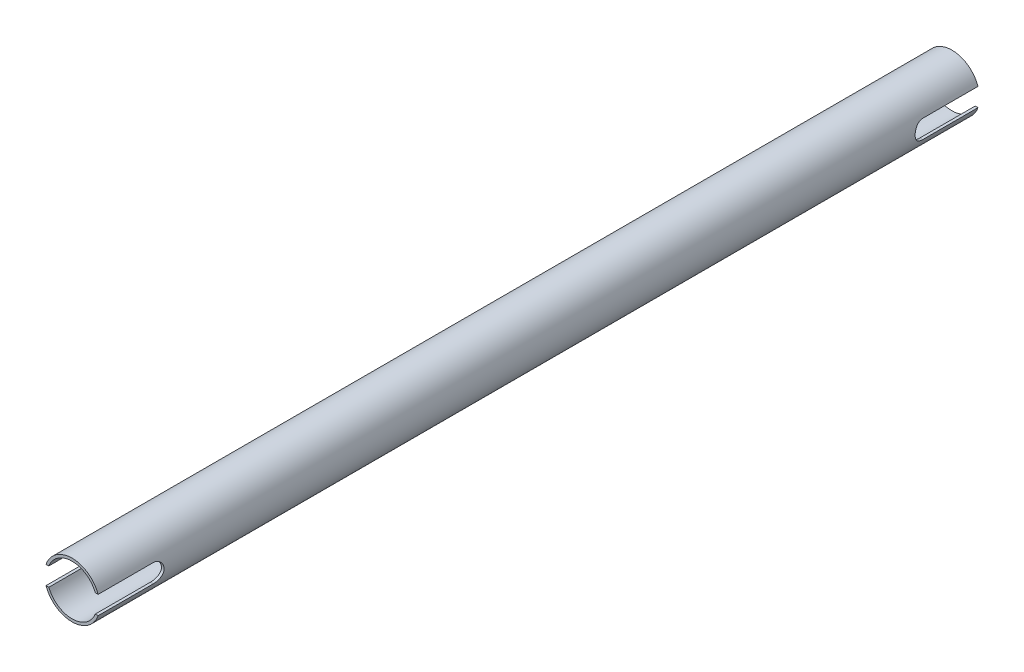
ISO-10303-21;
HEADER;
FILE_DESCRIPTION(('STEP AP214'),'2;1');
FILE_NAME('part.step','',(''),(''),'','','');
FILE_SCHEMA(('AUTOMOTIVE_DESIGN { 1 0 10303 214 1 1 1 1 }'));
ENDSEC;
DATA;
#1=APPLICATION_CONTEXT('core data for automotive mechanical design processes');
#2=APPLICATION_PROTOCOL_DEFINITION('international standard','automotive_design',2000,#1);
#3=PRODUCT_CONTEXT('',#1,'mechanical');
#4=PRODUCT('Part','Part','',(#3));
#5=PRODUCT_RELATED_PRODUCT_CATEGORY('part','',(#4));
#6=PRODUCT_DEFINITION_FORMATION('','',#4);
#7=PRODUCT_DEFINITION_CONTEXT('part definition',#1,'design');
#8=PRODUCT_DEFINITION('design','',#6,#7);
#9=PRODUCT_DEFINITION_SHAPE('','',#8);
#10=(LENGTH_UNIT() NAMED_UNIT(*) SI_UNIT(.MILLI.,.METRE.));
#11=(NAMED_UNIT(*) PLANE_ANGLE_UNIT() SI_UNIT($,.RADIAN.));
#12=(NAMED_UNIT(*) SI_UNIT($,.STERADIAN.) SOLID_ANGLE_UNIT());
#13=UNCERTAINTY_MEASURE_WITH_UNIT(LENGTH_MEASURE(1.E-05),#10,'distance_accuracy_value','');
#14=(GEOMETRIC_REPRESENTATION_CONTEXT(3) GLOBAL_UNCERTAINTY_ASSIGNED_CONTEXT((#13)) GLOBAL_UNIT_ASSIGNED_CONTEXT((#10,
#11,#12)) REPRESENTATION_CONTEXT('',''));
#15=CARTESIAN_POINT('',(0.,0.,0.));
#16=DIRECTION('',(0.,0.,1.));
#17=DIRECTION('',(1.,0.,0.));
#18=AXIS2_PLACEMENT_3D('',#15,#16,#17);
#19=CARTESIAN_POINT('',(0.,0.,151.69444769));
#20=DIRECTION('',(0.,0.,1.));
#21=DIRECTION('',(1.,0.,0.));
#22=AXIS2_PLACEMENT_3D('',#19,#20,#21);
#23=PLANE('',#22);
#24=CARTESIAN_POINT('',(0.,0.,151.69444769));
#25=DIRECTION('',(0.,0.,1.));
#26=DIRECTION('',(1.,0.,0.));
#27=AXIS2_PLACEMENT_3D('',#24,#25,#26);
#28=CIRCLE('',#27,9.525);
#29=CARTESIAN_POINT('',(8.98025612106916,3.17499999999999,151.69444769));
#30=VERTEX_POINT('',#29);
#31=CARTESIAN_POINT('',(-8.98025612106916,3.17499999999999,151.69444769));
#32=VERTEX_POINT('',#31);
#33=EDGE_CURVE('E180',#30,#32,#28,.T.);
#34=ORIENTED_EDGE('',*,*,#33,.T.);
#35=DIRECTION('',(1.,0.,0.));
#36=VECTOR('',#35,1.);
#37=CARTESIAN_POINT('',(-9.525,3.17499999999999,151.69444769));
#38=LINE('',#37,#36);
#39=CARTESIAN_POINT('',(-8.00659451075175,3.17499999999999,151.69444769));
#40=VERTEX_POINT('',#39);
#41=EDGE_CURVE('E447',#32,#40,#38,.T.);
#42=ORIENTED_EDGE('',*,*,#41,.T.);
#43=CARTESIAN_POINT('',(0.,0.,151.69444769));
#44=DIRECTION('',(0.,0.,1.));
#45=DIRECTION('',(1.,0.,0.));
#46=AXIS2_PLACEMENT_3D('',#43,#44,#45);
#47=CIRCLE('',#46,8.61314);
#48=CARTESIAN_POINT('',(8.00659451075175,3.17499999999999,151.69444769));
#49=VERTEX_POINT('',#48);
#50=EDGE_CURVE('E251',#49,#40,#47,.T.);
#51=ORIENTED_EDGE('',*,*,#50,.F.);
#52=EDGE_CURVE('E444',#49,#30,#38,.T.);
#53=ORIENTED_EDGE('',*,*,#52,.T.);
#54=EDGE_LOOP('',(#34,#42,#51,#53));
#55=FACE_BOUND('',#54,.T.);
#56=ADVANCED_FACE('F44',(#55),#23,.T.);
#57=CARTESIAN_POINT('',(-8.98025612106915,-3.17500000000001,151.69444769));
#58=VERTEX_POINT('',#57);
#59=CARTESIAN_POINT('',(8.98025612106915,-3.17500000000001,151.69444769));
#60=VERTEX_POINT('',#59);
#61=EDGE_CURVE('E172',#58,#60,#28,.T.);
#62=ORIENTED_EDGE('',*,*,#61,.T.);
#63=DIRECTION('',(1.,0.,0.));
#64=VECTOR('',#63,1.);
#65=CARTESIAN_POINT('',(-9.525,-3.17500000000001,151.69444769));
#66=LINE('',#65,#64);
#67=CARTESIAN_POINT('',(8.00659451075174,-3.17500000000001,151.69444769));
#68=VERTEX_POINT('',#67);
#69=EDGE_CURVE('E175',#68,#60,#66,.T.);
#70=ORIENTED_EDGE('',*,*,#69,.F.);
#71=CARTESIAN_POINT('',(-8.00659451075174,-3.17500000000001,151.69444769));
#72=VERTEX_POINT('',#71);
#73=EDGE_CURVE('E174',#72,#68,#47,.T.);
#74=ORIENTED_EDGE('',*,*,#73,.F.);
#75=EDGE_CURVE('E68',#58,#72,#66,.T.);
#76=ORIENTED_EDGE('',*,*,#75,.F.);
#77=EDGE_LOOP('',(#62,#70,#74,#76));
#78=FACE_BOUND('',#77,.T.);
#79=ADVANCED_FACE('F170',(#78),#23,.T.);
#80=CARTESIAN_POINT('',(0.,0.,151.69444769));
#81=DIRECTION('',(0.,0.,-1.));
#82=DIRECTION('',(-1.,0.,0.));
#83=AXIS2_PLACEMENT_3D('',#80,#81,#82);
#84=CYLINDRICAL_SURFACE('',#83,9.525);
#85=CARTESIAN_POINT('',(0.,0.,-151.69444769));
#86=DIRECTION('',(0.,0.,1.));
#87=DIRECTION('',(1.,0.,0.));
#88=AXIS2_PLACEMENT_3D('',#85,#86,#87);
#89=CIRCLE('',#88,9.525);
#90=CARTESIAN_POINT('',(-8.98025612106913,-3.17500000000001,-151.69444769));
#91=VERTEX_POINT('',#90);
#92=CARTESIAN_POINT('',(8.98025612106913,-3.17500000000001,-151.69444769));
#93=VERTEX_POINT('',#92);
#94=EDGE_CURVE('E186',#91,#93,#89,.T.);
#95=ORIENTED_EDGE('',*,*,#94,.T.);
#96=DIRECTION('',(0.,0.,-1.));
#97=VECTOR('',#96,1.);
#98=CARTESIAN_POINT('',(8.98025612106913,-3.17500000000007,151.69444769));
#99=LINE('',#98,#97);
#100=CARTESIAN_POINT('',(8.98025612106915,-3.17500000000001,-132.64444769));
#101=VERTEX_POINT('',#100);
#102=EDGE_CURVE('E236',#93,#101,#99,.F.);
#103=ORIENTED_EDGE('',*,*,#102,.T.);
#104=CARTESIAN_POINT('',(8.98025612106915,-3.17500000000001,-132.64444769));
#105=CARTESIAN_POINT('',(8.98024230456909,-3.17501141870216,-132.557824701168));
#106=CARTESIAN_POINT('',(8.98150913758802,-3.17145526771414,-132.471209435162));
#107=CARTESIAN_POINT('',(8.98650125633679,-3.15729678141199,-132.298650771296));
#108=CARTESIAN_POINT('',(8.99022587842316,-3.14669634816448,-132.212707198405));
#109=CARTESIAN_POINT('',(9.00001635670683,-3.11857973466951,-132.04235276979));
#110=CARTESIAN_POINT('',(9.0060752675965,-3.10108406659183,-131.95793813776));
#111=CARTESIAN_POINT('',(9.02033527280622,-3.05935609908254,-131.7909971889));
#112=CARTESIAN_POINT('',(9.0285364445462,-3.03512355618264,-131.708470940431));
#113=CARTESIAN_POINT('',(9.05598824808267,-2.95264270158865,-131.464666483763));
#114=CARTESIAN_POINT('',(9.07810279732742,-2.88456899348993,-131.306910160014));
#115=CARTESIAN_POINT('',(9.12745233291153,-2.7243758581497,-131.00503413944));
#116=CARTESIAN_POINT('',(9.15469046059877,-2.63224166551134,-130.860922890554));
#117=CARTESIAN_POINT('',(9.21240451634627,-2.42269004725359,-130.584770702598));
#118=CARTESIAN_POINT('',(9.24296080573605,-2.30449481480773,-130.453335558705));
#119=CARTESIAN_POINT('',(9.30318975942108,-2.04783780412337,-130.211740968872));
#120=CARTESIAN_POINT('',(9.33286226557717,-1.90937242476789,-130.101585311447));
#121=CARTESIAN_POINT('',(9.38891576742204,-1.61164171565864,-129.902900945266));
#122=CARTESIAN_POINT('',(9.4151906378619,-1.45192782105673,-129.815011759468));
#123=CARTESIAN_POINT('',(9.46053507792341,-1.1189628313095,-129.667592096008));
#124=CARTESIAN_POINT('',(9.47960684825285,-0.945715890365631,-129.608052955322));
#125=CARTESIAN_POINT('',(9.50782550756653,-0.596993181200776,-129.521086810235));
#126=CARTESIAN_POINT('',(9.5172945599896,-0.421804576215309,-129.49261481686));
#127=CARTESIAN_POINT('',(9.52638456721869,-0.0688942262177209,-129.465268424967));
#128=CARTESIAN_POINT('',(9.52600786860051,0.108826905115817,-129.466386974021));
#129=CARTESIAN_POINT('',(9.515666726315,0.454354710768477,-129.497528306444));
#130=CARTESIAN_POINT('',(9.50607893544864,0.622276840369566,-129.526415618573));
#131=CARTESIAN_POINT('',(9.47886599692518,0.950734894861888,-129.610396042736));
#132=CARTESIAN_POINT('',(9.4612404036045,1.11127040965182,-129.665490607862));
#133=CARTESIAN_POINT('',(9.41945246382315,1.422884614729,-129.800985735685));
#134=CARTESIAN_POINT('',(9.39520718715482,1.57381114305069,-129.881709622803));
#135=CARTESIAN_POINT('',(9.34270382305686,1.86031043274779,-130.065902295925));
#136=CARTESIAN_POINT('',(9.31444464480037,1.99587900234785,-130.169377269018));
#137=CARTESIAN_POINT('',(9.25532407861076,2.25455959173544,-130.401856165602));
#138=CARTESIAN_POINT('',(9.22440281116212,2.37678676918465,-130.531831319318));
#139=CARTESIAN_POINT('',(9.16455803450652,2.5980116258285,-130.810688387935));
#140=CARTESIAN_POINT('',(9.13563517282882,2.69700180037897,-130.959576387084));
#141=CARTESIAN_POINT('',(9.08272269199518,2.87021834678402,-131.275049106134));
#142=CARTESIAN_POINT('',(9.05881220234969,2.944057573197,-131.441862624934));
#143=CARTESIAN_POINT('',(9.02936653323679,3.03267330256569,-131.700080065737));
#144=CARTESIAN_POINT('',(9.02062228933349,3.05851877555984,-131.787469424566));
#145=CARTESIAN_POINT('',(9.00554368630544,3.1026369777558,-131.964331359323));
#146=CARTESIAN_POINT('',(8.99920822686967,3.12091316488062,-132.053802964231));
#147=CARTESIAN_POINT('',(8.98959087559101,3.14850521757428,-132.226652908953));
#148=CARTESIAN_POINT('',(8.9860995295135,3.15843785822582,-132.309922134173));
#149=CARTESIAN_POINT('',(8.98142776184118,3.17168561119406,-132.476940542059));
#150=CARTESIAN_POINT('',(8.98024435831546,3.17500926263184,-132.560688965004));
#151=CARTESIAN_POINT('',(8.98025612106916,3.17499999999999,-132.64444769));
#152=B_SPLINE_CURVE_WITH_KNOTS('',3,(#104,#105,#106,#107,#108,#109,#110,#111,#112,#113,#114,
#115,#116,#117,#118,#119,#120,#121,#122,#123,#124,#125,#126,#127,#128,#129,#130,#131,#132,#133,
#134,#135,#136,#137,#138,#139,#140,#141,#142,#143,#144,#145,#146,#147,#148,#149,#150,#151),
.UNSPECIFIED.,.F.,.F.,(4,2,2,2,2,2,2,2,2,2,2,2,2,2,2,2,2,2,2,2,2,2,2,4),(0.,0.259773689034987,
0.519477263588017,0.778414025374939,1.03736014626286,1.55449291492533,2.07194378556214,
2.60766387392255,3.14347925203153,3.69327981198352,4.24291225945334,4.77342553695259,
5.30381237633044,5.81339512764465,6.32300613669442,6.83932018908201,7.35577482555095,
7.89650105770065,8.43740168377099,8.98628729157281,9.26063415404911,9.5348555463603,
9.78636405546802,10.0375473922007),.UNSPECIFIED.);
#153=CARTESIAN_POINT('',(8.98025612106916,3.17499999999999,-132.64444769));
#154=VERTEX_POINT('',#153);
#155=EDGE_CURVE('E228',#101,#154,#152,.T.);
#156=ORIENTED_EDGE('',*,*,#155,.T.);
#157=DIRECTION('',(0.,0.,-1.));
#158=VECTOR('',#157,1.);
#159=CARTESIAN_POINT('',(8.98025612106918,3.17499999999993,151.69444769));
#160=LINE('',#159,#158);
#161=CARTESIAN_POINT('',(8.98025612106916,3.17499999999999,-151.69444769));
#162=VERTEX_POINT('',#161);
#163=EDGE_CURVE('E245',#154,#162,#160,.T.);
#164=ORIENTED_EDGE('',*,*,#163,.T.);
#165=CARTESIAN_POINT('',(-8.98025612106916,3.17499999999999,-151.69444769));
#166=VERTEX_POINT('',#165);
#167=EDGE_CURVE('E181',#162,#166,#89,.T.);
#168=ORIENTED_EDGE('',*,*,#167,.T.);
#169=DIRECTION('',(0.,0.,-1.));
#170=VECTOR('',#169,1.);
#171=CARTESIAN_POINT('',(-8.98025612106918,3.17499999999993,151.69444769));
#172=LINE('',#171,#170);
#173=CARTESIAN_POINT('',(-8.98025612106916,3.17499999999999,-132.64444769));
#174=VERTEX_POINT('',#173);
#175=EDGE_CURVE('E242',#166,#174,#172,.F.);
#176=ORIENTED_EDGE('',*,*,#175,.T.);
#177=CARTESIAN_POINT('',(-8.98025612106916,3.17499999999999,-132.64444769));
#178=CARTESIAN_POINT('',(-8.9802423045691,3.17501141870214,-132.557824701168));
#179=CARTESIAN_POINT('',(-8.98150913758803,3.17145526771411,-132.471209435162));
#180=CARTESIAN_POINT('',(-8.9865012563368,3.15729678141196,-132.298650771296));
#181=CARTESIAN_POINT('',(-8.99022587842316,3.14669634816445,-132.212707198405));
#182=CARTESIAN_POINT('',(-9.00001635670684,3.11857973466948,-132.04235276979));
#183=CARTESIAN_POINT('',(-9.00607526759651,3.1010840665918,-131.95793813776));
#184=CARTESIAN_POINT('',(-9.02033527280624,3.05935609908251,-131.7909971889));
#185=CARTESIAN_POINT('',(-9.02853644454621,3.03512355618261,-131.708470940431));
#186=CARTESIAN_POINT('',(-9.05598824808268,2.95264270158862,-131.464666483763));
#187=CARTESIAN_POINT('',(-9.07810279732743,2.8845689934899,-131.306910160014));
#188=CARTESIAN_POINT('',(-9.12745233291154,2.72437585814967,-131.00503413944));
#189=CARTESIAN_POINT('',(-9.15469046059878,2.63224166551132,-130.860922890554));
#190=CARTESIAN_POINT('',(-9.21240451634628,2.42269004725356,-130.584770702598));
#191=CARTESIAN_POINT('',(-9.24296080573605,2.3044948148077,-130.453335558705));
#192=CARTESIAN_POINT('',(-9.30318975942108,2.04783780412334,-130.211740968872));
#193=CARTESIAN_POINT('',(-9.33286226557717,1.90937242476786,-130.101585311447));
#194=CARTESIAN_POINT('',(-9.38891576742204,1.61164171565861,-129.902900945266));
#195=CARTESIAN_POINT('',(-9.41519063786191,1.4519278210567,-129.815011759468));
#196=CARTESIAN_POINT('',(-9.46053507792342,1.11896283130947,-129.667592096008));
#197=CARTESIAN_POINT('',(-9.47960684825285,0.945715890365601,-129.608052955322));
#198=CARTESIAN_POINT('',(-9.50782550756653,0.596993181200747,-129.521086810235));
#199=CARTESIAN_POINT('',(-9.5172945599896,0.42180457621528,-129.49261481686));
#200=CARTESIAN_POINT('',(-9.52638456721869,0.0688942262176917,-129.465268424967));
#201=CARTESIAN_POINT('',(-9.52600786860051,-0.108826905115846,-129.466386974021));
#202=CARTESIAN_POINT('',(-9.515666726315,-0.454354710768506,-129.497528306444));
#203=CARTESIAN_POINT('',(-9.50607893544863,-0.622276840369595,-129.526415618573));
#204=CARTESIAN_POINT('',(-9.47886599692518,-0.950734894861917,-129.610396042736));
#205=CARTESIAN_POINT('',(-9.4612404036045,-1.11127040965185,-129.665490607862));
#206=CARTESIAN_POINT('',(-9.41945246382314,-1.42288461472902,-129.800985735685));
#207=CARTESIAN_POINT('',(-9.39520718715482,-1.57381114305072,-129.881709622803));
#208=CARTESIAN_POINT('',(-9.34270382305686,-1.86031043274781,-130.065902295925));
#209=CARTESIAN_POINT('',(-9.31444464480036,-1.99587900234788,-130.169377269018));
#210=CARTESIAN_POINT('',(-9.25532407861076,-2.25455959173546,-130.401856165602));
#211=CARTESIAN_POINT('',(-9.22440281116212,-2.37678676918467,-130.531831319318));
#212=CARTESIAN_POINT('',(-9.16455803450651,-2.59801162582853,-130.810688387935));
#213=CARTESIAN_POINT('',(-9.13563517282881,-2.697001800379,-130.959576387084));
#214=CARTESIAN_POINT('',(-9.08272269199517,-2.87021834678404,-131.275049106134));
#215=CARTESIAN_POINT('',(-9.05881220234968,-2.94405757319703,-131.441862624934));
#216=CARTESIAN_POINT('',(-9.02936653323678,-3.03267330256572,-131.700080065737));
#217=CARTESIAN_POINT('',(-9.02062228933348,-3.05851877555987,-131.787469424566));
#218=CARTESIAN_POINT('',(-9.00554368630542,-3.10263697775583,-131.964331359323));
#219=CARTESIAN_POINT('',(-8.99920822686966,-3.12091316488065,-132.053802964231));
#220=CARTESIAN_POINT('',(-8.989590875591,-3.14850521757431,-132.226652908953));
#221=CARTESIAN_POINT('',(-8.98609952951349,-3.15843785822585,-132.309922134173));
#222=CARTESIAN_POINT('',(-8.98142776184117,-3.17168561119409,-132.476940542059));
#223=CARTESIAN_POINT('',(-8.98024435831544,-3.17500926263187,-132.560688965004));
#224=CARTESIAN_POINT('',(-8.98025612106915,-3.17500000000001,-132.64444769));
#225=B_SPLINE_CURVE_WITH_KNOTS('',3,(#177,#178,#179,#180,#181,#182,#183,#184,#185,#186,#187,
#188,#189,#190,#191,#192,#193,#194,#195,#196,#197,#198,#199,#200,#201,#202,#203,#204,#205,#206,
#207,#208,#209,#210,#211,#212,#213,#214,#215,#216,#217,#218,#219,#220,#221,#222,#223,#224),
.UNSPECIFIED.,.F.,.F.,(4,2,2,2,2,2,2,2,2,2,2,2,2,2,2,2,2,2,2,2,2,2,2,4),(0.,0.259773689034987,
0.519477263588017,0.778414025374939,1.03736014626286,1.55449291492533,2.07194378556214,
2.60766387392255,3.14347925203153,3.69327981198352,4.24291225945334,4.77342553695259,
5.30381237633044,5.81339512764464,6.32300613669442,6.83932018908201,7.35577482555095,
7.89650105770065,8.43740168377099,8.98628729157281,9.26063415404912,9.5348555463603,
9.78636405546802,10.0375473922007),.UNSPECIFIED.);
#226=CARTESIAN_POINT('',(-8.98025612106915,-3.17500000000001,-132.64444769));
#227=VERTEX_POINT('',#226);
#228=EDGE_CURVE('E223',#174,#227,#225,.T.);
#229=ORIENTED_EDGE('',*,*,#228,.T.);
#230=DIRECTION('',(0.,0.,-1.));
#231=VECTOR('',#230,1.);
#232=CARTESIAN_POINT('',(-8.98025612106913,-3.17500000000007,151.69444769));
#233=LINE('',#232,#231);
#234=EDGE_CURVE('E239',#227,#91,#233,.T.);
#235=ORIENTED_EDGE('',*,*,#234,.T.);
#236=EDGE_LOOP('',(#95,#103,#156,#164,#168,#176,#229,#235));
#237=FACE_BOUND('',#236,.T.);
#238=DIRECTION('',(0.,0.,-1.));
#239=VECTOR('',#238,1.);
#240=CARTESIAN_POINT('',(-8.98025612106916,3.17499999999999,151.69444769));
#241=LINE('',#240,#239);
#242=CARTESIAN_POINT('',(-8.98025612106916,3.17499999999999,132.64444769));
#243=VERTEX_POINT('',#242);
#244=EDGE_CURVE('E303',#32,#243,#241,.T.);
#245=ORIENTED_EDGE('',*,*,#244,.F.);
#246=ORIENTED_EDGE('',*,*,#33,.F.);
#247=DIRECTION('',(0.,0.,-1.));
#248=VECTOR('',#247,1.);
#249=CARTESIAN_POINT('',(8.98025612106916,3.17499999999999,151.69444769));
#250=LINE('',#249,#248);
#251=CARTESIAN_POINT('',(8.98025612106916,3.17499999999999,132.64444769));
#252=VERTEX_POINT('',#251);
#253=EDGE_CURVE('E301',#252,#30,#250,.F.);
#254=ORIENTED_EDGE('',*,*,#253,.F.);
#255=CARTESIAN_POINT('',(8.98025612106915,-3.17500000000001,132.64444769));
#256=CARTESIAN_POINT('',(8.98024230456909,-3.17501141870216,132.557824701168));
#257=CARTESIAN_POINT('',(8.98150913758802,-3.17145526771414,132.471209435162));
#258=CARTESIAN_POINT('',(8.98650125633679,-3.15729678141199,132.298650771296));
#259=CARTESIAN_POINT('',(8.99022587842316,-3.14669634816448,132.212707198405));
#260=CARTESIAN_POINT('',(9.00001635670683,-3.11857973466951,132.04235276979));
#261=CARTESIAN_POINT('',(9.0060752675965,-3.10108406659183,131.95793813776));
#262=CARTESIAN_POINT('',(9.02033527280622,-3.05935609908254,131.7909971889));
#263=CARTESIAN_POINT('',(9.0285364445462,-3.03512355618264,131.708470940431));
#264=CARTESIAN_POINT('',(9.05598824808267,-2.95264270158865,131.464666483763));
#265=CARTESIAN_POINT('',(9.07810279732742,-2.88456899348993,131.306910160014));
#266=CARTESIAN_POINT('',(9.12745233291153,-2.7243758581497,131.00503413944));
#267=CARTESIAN_POINT('',(9.15469046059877,-2.63224166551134,130.860922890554));
#268=CARTESIAN_POINT('',(9.21240451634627,-2.42269004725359,130.584770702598));
#269=CARTESIAN_POINT('',(9.24296080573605,-2.30449481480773,130.453335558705));
#270=CARTESIAN_POINT('',(9.30318975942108,-2.04783780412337,130.211740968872));
#271=CARTESIAN_POINT('',(9.33286226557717,-1.90937242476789,130.101585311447));
#272=CARTESIAN_POINT('',(9.38891576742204,-1.61164171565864,129.902900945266));
#273=CARTESIAN_POINT('',(9.4151906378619,-1.45192782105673,129.815011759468));
#274=CARTESIAN_POINT('',(9.46053507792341,-1.1189628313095,129.667592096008));
#275=CARTESIAN_POINT('',(9.47960684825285,-0.945715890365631,129.608052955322));
#276=CARTESIAN_POINT('',(9.50782550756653,-0.596993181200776,129.521086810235));
#277=CARTESIAN_POINT('',(9.5172945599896,-0.421804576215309,129.49261481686));
#278=CARTESIAN_POINT('',(9.52638456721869,-0.0688942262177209,129.465268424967));
#279=CARTESIAN_POINT('',(9.52600786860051,0.108826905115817,129.466386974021));
#280=CARTESIAN_POINT('',(9.515666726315,0.454354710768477,129.497528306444));
#281=CARTESIAN_POINT('',(9.50607893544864,0.622276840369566,129.526415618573));
#282=CARTESIAN_POINT('',(9.47886599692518,0.950734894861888,129.610396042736));
#283=CARTESIAN_POINT('',(9.4612404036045,1.11127040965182,129.665490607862));
#284=CARTESIAN_POINT('',(9.41945246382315,1.422884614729,129.800985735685));
#285=CARTESIAN_POINT('',(9.39520718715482,1.57381114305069,129.881709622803));
#286=CARTESIAN_POINT('',(9.34270382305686,1.86031043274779,130.065902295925));
#287=CARTESIAN_POINT('',(9.31444464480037,1.99587900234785,130.169377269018));
#288=CARTESIAN_POINT('',(9.25532407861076,2.25455959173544,130.401856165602));
#289=CARTESIAN_POINT('',(9.22440281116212,2.37678676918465,130.531831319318));
#290=CARTESIAN_POINT('',(9.16455803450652,2.5980116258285,130.810688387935));
#291=CARTESIAN_POINT('',(9.13563517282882,2.69700180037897,130.959576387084));
#292=CARTESIAN_POINT('',(9.08272269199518,2.87021834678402,131.275049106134));
#293=CARTESIAN_POINT('',(9.05881220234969,2.944057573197,131.441862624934));
#294=CARTESIAN_POINT('',(9.02936653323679,3.03267330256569,131.700080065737));
#295=CARTESIAN_POINT('',(9.02062228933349,3.05851877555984,131.787469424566));
#296=CARTESIAN_POINT('',(9.00554368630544,3.1026369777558,131.964331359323));
#297=CARTESIAN_POINT('',(8.99920822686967,3.12091316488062,132.053802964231));
#298=CARTESIAN_POINT('',(8.98959087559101,3.14850521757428,132.226652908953));
#299=CARTESIAN_POINT('',(8.9860995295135,3.15843785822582,132.309922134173));
#300=CARTESIAN_POINT('',(8.98142776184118,3.17168561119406,132.476940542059));
#301=CARTESIAN_POINT('',(8.98024435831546,3.17500926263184,132.560688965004));
#302=CARTESIAN_POINT('',(8.98025612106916,3.17499999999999,132.64444769));
#303=B_SPLINE_CURVE_WITH_KNOTS('',3,(#255,#256,#257,#258,#259,#260,#261,#262,#263,#264,#265,
#266,#267,#268,#269,#270,#271,#272,#273,#274,#275,#276,#277,#278,#279,#280,#281,#282,#283,#284,
#285,#286,#287,#288,#289,#290,#291,#292,#293,#294,#295,#296,#297,#298,#299,#300,#301,#302),
.UNSPECIFIED.,.F.,.F.,(4,2,2,2,2,2,2,2,2,2,2,2,2,2,2,2,2,2,2,2,2,2,2,4),(0.,0.259773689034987,
0.519477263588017,0.778414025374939,1.03736014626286,1.55449291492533,2.07194378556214,
2.60766387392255,3.14347925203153,3.69327981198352,4.24291225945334,4.77342553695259,
5.30381237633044,5.81339512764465,6.32300613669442,6.83932018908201,7.35577482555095,
7.89650105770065,8.43740168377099,8.98628729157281,9.26063415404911,9.5348555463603,
9.78636405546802,10.0375473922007),.UNSPECIFIED.);
#304=CARTESIAN_POINT('',(8.98025612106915,-3.17500000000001,132.64444769));
#305=VERTEX_POINT('',#304);
#306=EDGE_CURVE('E291',#305,#252,#303,.T.);
#307=ORIENTED_EDGE('',*,*,#306,.F.);
#308=DIRECTION('',(0.,0.,-1.));
#309=VECTOR('',#308,1.);
#310=CARTESIAN_POINT('',(8.98025612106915,-3.17500000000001,151.69444769));
#311=LINE('',#310,#309);
#312=EDGE_CURVE('E164',#60,#305,#311,.T.);
#313=ORIENTED_EDGE('',*,*,#312,.F.);
#314=ORIENTED_EDGE('',*,*,#61,.F.);
#315=DIRECTION('',(0.,0.,-1.));
#316=VECTOR('',#315,1.);
#317=CARTESIAN_POINT('',(-8.98025612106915,-3.17500000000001,151.69444769));
#318=LINE('',#317,#316);
#319=CARTESIAN_POINT('',(-8.98025612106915,-3.17500000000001,132.64444769));
#320=VERTEX_POINT('',#319);
#321=EDGE_CURVE('E157',#320,#58,#318,.F.);
#322=ORIENTED_EDGE('',*,*,#321,.F.);
#323=CARTESIAN_POINT('',(-8.98025612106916,3.17499999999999,132.64444769));
#324=CARTESIAN_POINT('',(-8.9802423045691,3.17501141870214,132.557824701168));
#325=CARTESIAN_POINT('',(-8.98150913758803,3.17145526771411,132.471209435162));
#326=CARTESIAN_POINT('',(-8.9865012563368,3.15729678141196,132.298650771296));
#327=CARTESIAN_POINT('',(-8.99022587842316,3.14669634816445,132.212707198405));
#328=CARTESIAN_POINT('',(-9.00001635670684,3.11857973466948,132.04235276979));
#329=CARTESIAN_POINT('',(-9.00607526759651,3.1010840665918,131.95793813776));
#330=CARTESIAN_POINT('',(-9.02033527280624,3.05935609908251,131.7909971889));
#331=CARTESIAN_POINT('',(-9.02853644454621,3.03512355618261,131.708470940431));
#332=CARTESIAN_POINT('',(-9.05598824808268,2.95264270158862,131.464666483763));
#333=CARTESIAN_POINT('',(-9.07810279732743,2.8845689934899,131.306910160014));
#334=CARTESIAN_POINT('',(-9.12745233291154,2.72437585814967,131.00503413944));
#335=CARTESIAN_POINT('',(-9.15469046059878,2.63224166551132,130.860922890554));
#336=CARTESIAN_POINT('',(-9.21240451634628,2.42269004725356,130.584770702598));
#337=CARTESIAN_POINT('',(-9.24296080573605,2.3044948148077,130.453335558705));
#338=CARTESIAN_POINT('',(-9.30318975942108,2.04783780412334,130.211740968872));
#339=CARTESIAN_POINT('',(-9.33286226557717,1.90937242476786,130.101585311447));
#340=CARTESIAN_POINT('',(-9.38891576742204,1.61164171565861,129.902900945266));
#341=CARTESIAN_POINT('',(-9.41519063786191,1.4519278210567,129.815011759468));
#342=CARTESIAN_POINT('',(-9.46053507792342,1.11896283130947,129.667592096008));
#343=CARTESIAN_POINT('',(-9.47960684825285,0.945715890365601,129.608052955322));
#344=CARTESIAN_POINT('',(-9.50782550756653,0.596993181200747,129.521086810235));
#345=CARTESIAN_POINT('',(-9.5172945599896,0.42180457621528,129.49261481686));
#346=CARTESIAN_POINT('',(-9.52638456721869,0.0688942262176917,129.465268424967));
#347=CARTESIAN_POINT('',(-9.52600786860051,-0.108826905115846,129.466386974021));
#348=CARTESIAN_POINT('',(-9.515666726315,-0.454354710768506,129.497528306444));
#349=CARTESIAN_POINT('',(-9.50607893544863,-0.622276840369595,129.526415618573));
#350=CARTESIAN_POINT('',(-9.47886599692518,-0.950734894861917,129.610396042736));
#351=CARTESIAN_POINT('',(-9.4612404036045,-1.11127040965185,129.665490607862));
#352=CARTESIAN_POINT('',(-9.41945246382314,-1.42288461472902,129.800985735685));
#353=CARTESIAN_POINT('',(-9.39520718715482,-1.57381114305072,129.881709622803));
#354=CARTESIAN_POINT('',(-9.34270382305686,-1.86031043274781,130.065902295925));
#355=CARTESIAN_POINT('',(-9.31444464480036,-1.99587900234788,130.169377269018));
#356=CARTESIAN_POINT('',(-9.25532407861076,-2.25455959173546,130.401856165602));
#357=CARTESIAN_POINT('',(-9.22440281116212,-2.37678676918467,130.531831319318));
#358=CARTESIAN_POINT('',(-9.16455803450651,-2.59801162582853,130.810688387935));
#359=CARTESIAN_POINT('',(-9.13563517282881,-2.697001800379,130.959576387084));
#360=CARTESIAN_POINT('',(-9.08272269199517,-2.87021834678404,131.275049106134));
#361=CARTESIAN_POINT('',(-9.05881220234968,-2.94405757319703,131.441862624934));
#362=CARTESIAN_POINT('',(-9.02936653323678,-3.03267330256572,131.700080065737));
#363=CARTESIAN_POINT('',(-9.02062228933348,-3.05851877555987,131.787469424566));
#364=CARTESIAN_POINT('',(-9.00554368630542,-3.10263697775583,131.964331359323));
#365=CARTESIAN_POINT('',(-8.99920822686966,-3.12091316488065,132.053802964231));
#366=CARTESIAN_POINT('',(-8.989590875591,-3.14850521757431,132.226652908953));
#367=CARTESIAN_POINT('',(-8.98609952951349,-3.15843785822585,132.309922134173));
#368=CARTESIAN_POINT('',(-8.98142776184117,-3.17168561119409,132.476940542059));
#369=CARTESIAN_POINT('',(-8.98024435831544,-3.17500926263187,132.560688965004));
#370=CARTESIAN_POINT('',(-8.98025612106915,-3.17500000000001,132.64444769));
#371=B_SPLINE_CURVE_WITH_KNOTS('',3,(#323,#324,#325,#326,#327,#328,#329,#330,#331,#332,#333,
#334,#335,#336,#337,#338,#339,#340,#341,#342,#343,#344,#345,#346,#347,#348,#349,#350,#351,#352,
#353,#354,#355,#356,#357,#358,#359,#360,#361,#362,#363,#364,#365,#366,#367,#368,#369,#370),
.UNSPECIFIED.,.F.,.F.,(4,2,2,2,2,2,2,2,2,2,2,2,2,2,2,2,2,2,2,2,2,2,2,4),(0.,0.259773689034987,
0.519477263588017,0.778414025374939,1.03736014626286,1.55449291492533,2.07194378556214,
2.60766387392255,3.14347925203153,3.69327981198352,4.24291225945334,4.77342553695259,
5.30381237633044,5.81339512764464,6.32300613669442,6.83932018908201,7.35577482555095,
7.89650105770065,8.43740168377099,8.98628729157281,9.26063415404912,9.5348555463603,
9.78636405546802,10.0375473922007),.UNSPECIFIED.);
#372=EDGE_CURVE('E296',#243,#320,#371,.T.);
#373=ORIENTED_EDGE('',*,*,#372,.F.);
#374=EDGE_LOOP('',(#245,#246,#254,#307,#313,#314,#322,#373));
#375=FACE_BOUND('',#374,.T.);
#376=ADVANCED_FACE('F46',(#237,#375),#84,.T.);
#377=CARTESIAN_POINT('',(0.,0.,151.69444769));
#378=DIRECTION('',(0.,0.,-1.));
#379=DIRECTION('',(-1.,0.,0.));
#380=AXIS2_PLACEMENT_3D('',#377,#378,#379);
#381=CYLINDRICAL_SURFACE('',#380,8.61314);
#382=DIRECTION('',(0.,0.,-1.));
#383=VECTOR('',#382,1.);
#384=CARTESIAN_POINT('',(8.00659451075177,3.17499999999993,151.69444769));
#385=LINE('',#384,#383);
#386=CARTESIAN_POINT('',(8.00659451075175,3.17499999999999,-132.64444769));
#387=VERTEX_POINT('',#386);
#388=CARTESIAN_POINT('',(8.00659451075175,3.17499999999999,-151.69444769));
#389=VERTEX_POINT('',#388);
#390=EDGE_CURVE('E263',#387,#389,#385,.T.);
#391=ORIENTED_EDGE('',*,*,#390,.F.);
#392=CARTESIAN_POINT('',(8.00659451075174,-3.17500000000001,-132.64444769));
#393=CARTESIAN_POINT('',(8.00657879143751,-3.17501205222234,-132.558433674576));
#394=CARTESIAN_POINT('',(8.00798019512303,-3.17150498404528,-132.472428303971));
#395=CARTESIAN_POINT('',(8.01350001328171,-3.15754665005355,-132.301097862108));
#396=CARTESIAN_POINT('',(8.01761754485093,-3.14709764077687,-132.215772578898));
#397=CARTESIAN_POINT('',(8.02843384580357,-3.11939719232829,-132.046700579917));
#398=CARTESIAN_POINT('',(8.03512366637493,-3.10216933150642,-131.962949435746));
#399=CARTESIAN_POINT('',(8.05086033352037,-3.06109615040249,-131.797332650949));
#400=CARTESIAN_POINT('',(8.05990729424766,-3.03725050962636,-131.715467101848));
#401=CARTESIAN_POINT('',(8.09016839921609,-2.95613292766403,-131.473667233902));
#402=CARTESIAN_POINT('',(8.11452302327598,-2.8892315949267,-131.317236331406));
#403=CARTESIAN_POINT('',(8.16883258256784,-2.7318939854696,-131.01777223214));
#404=CARTESIAN_POINT('',(8.19879191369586,-2.64143921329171,-130.874749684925));
#405=CARTESIAN_POINT('',(8.26253332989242,-2.43492887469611,-130.599301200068));
#406=CARTESIAN_POINT('',(8.29642486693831,-2.31793297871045,-130.467604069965));
#407=CARTESIAN_POINT('',(8.36329714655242,-2.06366320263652,-130.225193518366));
#408=CARTESIAN_POINT('',(8.396277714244,-1.92638546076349,-130.114484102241));
#409=CARTESIAN_POINT('',(8.45891569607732,-1.629904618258,-129.913676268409));
#410=CARTESIAN_POINT('',(8.48842893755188,-1.4701307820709,-129.824371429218));
#411=CARTESIAN_POINT('',(8.53948707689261,-1.13655272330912,-129.674212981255));
#412=CARTESIAN_POINT('',(8.56103485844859,-0.962753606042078,-129.613349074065));
#413=CARTESIAN_POINT('',(8.59295493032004,-0.613765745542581,-129.52435569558));
#414=CARTESIAN_POINT('',(8.60375681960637,-0.438938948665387,-129.494963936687));
#415=CARTESIAN_POINT('',(8.61450719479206,-0.0865198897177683,-129.465709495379));
#416=CARTESIAN_POINT('',(8.61445889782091,0.0910715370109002,-129.465838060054));
#417=CARTESIAN_POINT('',(8.60379005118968,0.434944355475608,-129.494876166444));
#418=CARTESIAN_POINT('',(8.59367530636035,0.601360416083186,-129.522408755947));
#419=CARTESIAN_POINT('',(8.56466915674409,0.927017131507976,-129.603162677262));
#420=CARTESIAN_POINT('',(8.54577725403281,1.08625737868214,-129.656385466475));
#421=CARTESIAN_POINT('',(8.50075667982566,1.39575977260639,-129.787674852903));
#422=CARTESIAN_POINT('',(8.47452782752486,1.5458598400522,-129.866087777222));
#423=CARTESIAN_POINT('',(8.41749996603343,1.83113878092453,-130.045226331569));
#424=CARTESIAN_POINT('',(8.38669950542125,1.966312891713,-130.145959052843));
#425=CARTESIAN_POINT('',(8.32165508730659,2.22602120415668,-130.373562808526));
#426=CARTESIAN_POINT('',(8.28731490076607,2.34951911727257,-130.501591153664));
#427=CARTESIAN_POINT('',(8.22046423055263,2.573686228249,-130.776749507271));
#428=CARTESIAN_POINT('',(8.18795444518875,2.67434675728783,-130.923886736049));
#429=CARTESIAN_POINT('',(8.12783577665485,2.85192851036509,-131.23726302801));
#430=CARTESIAN_POINT('',(8.10034614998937,2.92829789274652,-131.403842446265));
#431=CARTESIAN_POINT('',(8.06616055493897,3.02064378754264,-131.662239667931));
#432=CARTESIAN_POINT('',(8.05594153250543,3.04772112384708,-131.749774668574));
#433=CARTESIAN_POINT('',(8.03818255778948,3.0942567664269,-131.927100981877));
#434=CARTESIAN_POINT('',(8.03064139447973,3.11371851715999,-132.016891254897));
#435=CARTESIAN_POINT('',(8.01865729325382,3.14445483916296,-132.196006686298));
#436=CARTESIAN_POINT('',(8.01414947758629,3.15590108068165,-132.285298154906));
#437=CARTESIAN_POINT('',(8.00811024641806,3.17117692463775,-132.464538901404));
#438=CARTESIAN_POINT('',(8.00657586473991,3.17501411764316,-132.554487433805));
#439=CARTESIAN_POINT('',(8.00659451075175,3.17499999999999,-132.64444769));
#440=B_SPLINE_CURVE_WITH_KNOTS('',3,(#392,#393,#394,#395,#396,#397,#398,#399,#400,#401,#402,
#403,#404,#405,#406,#407,#408,#409,#410,#411,#412,#413,#414,#415,#416,#417,#418,#419,#420,#421,
#422,#423,#424,#425,#426,#427,#428,#429,#430,#431,#432,#433,#434,#435,#436,#437,#438,#439),
.UNSPECIFIED.,.F.,.F.,(4,2,2,2,2,2,2,2,2,2,2,2,2,2,2,2,2,2,2,2,2,2,2,4),(0.,0.257944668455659,
0.51580553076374,0.772777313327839,1.0297615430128,1.54284702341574,2.05633662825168,
2.59210103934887,3.1279675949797,3.68138042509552,4.23459270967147,4.76467407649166,
5.29459827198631,5.79917501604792,6.30378038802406,6.81564369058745,7.32766985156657,
7.86869704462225,8.40992926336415,8.96269988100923,9.23897231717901,9.51511965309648,
9.78515512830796,10.0549210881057),.UNSPECIFIED.);
#441=CARTESIAN_POINT('',(8.00659451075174,-3.17500000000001,-132.64444769));
#442=VERTEX_POINT('',#441);
#443=EDGE_CURVE('E217',#442,#387,#440,.T.);
#444=ORIENTED_EDGE('',*,*,#443,.F.);
#445=DIRECTION('',(0.,0.,-1.));
#446=VECTOR('',#445,1.);
#447=CARTESIAN_POINT('',(8.00659451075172,-3.17500000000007,151.69444769));
#448=LINE('',#447,#446);
#449=CARTESIAN_POINT('',(8.00659451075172,-3.17500000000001,-151.69444769));
#450=VERTEX_POINT('',#449);
#451=EDGE_CURVE('E267',#450,#442,#448,.F.);
#452=ORIENTED_EDGE('',*,*,#451,.F.);
#453=CARTESIAN_POINT('',(0.,0.,-151.69444769));
#454=DIRECTION('',(0.,0.,1.));
#455=DIRECTION('',(1.,0.,0.));
#456=AXIS2_PLACEMENT_3D('',#453,#454,#455);
#457=CIRCLE('',#456,8.61314);
#458=CARTESIAN_POINT('',(-8.00659451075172,-3.17500000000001,-151.69444769));
#459=VERTEX_POINT('',#458);
#460=EDGE_CURVE('E248',#459,#450,#457,.T.);
#461=ORIENTED_EDGE('',*,*,#460,.F.);
#462=DIRECTION('',(0.,0.,-1.));
#463=VECTOR('',#462,1.);
#464=CARTESIAN_POINT('',(-8.00659451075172,-3.17500000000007,151.69444769));
#465=LINE('',#464,#463);
#466=CARTESIAN_POINT('',(-8.00659451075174,-3.17500000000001,-132.64444769));
#467=VERTEX_POINT('',#466);
#468=EDGE_CURVE('E196',#467,#459,#465,.T.);
#469=ORIENTED_EDGE('',*,*,#468,.F.);
#470=CARTESIAN_POINT('',(-8.00659451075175,3.17499999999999,-132.64444769));
#471=CARTESIAN_POINT('',(-8.00657879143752,3.17501205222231,-132.558433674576));
#472=CARTESIAN_POINT('',(-8.00798019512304,3.17150498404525,-132.472428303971));
#473=CARTESIAN_POINT('',(-8.01350001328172,3.15754665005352,-132.301097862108));
#474=CARTESIAN_POINT('',(-8.01761754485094,3.14709764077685,-132.215772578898));
#475=CARTESIAN_POINT('',(-8.02843384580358,3.11939719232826,-132.046700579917));
#476=CARTESIAN_POINT('',(-8.03512366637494,3.10216933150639,-131.962949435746));
#477=CARTESIAN_POINT('',(-8.05086033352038,3.06109615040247,-131.797332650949));
#478=CARTESIAN_POINT('',(-8.05990729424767,3.03725050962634,-131.715467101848));
#479=CARTESIAN_POINT('',(-8.0901683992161,2.956132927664,-131.473667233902));
#480=CARTESIAN_POINT('',(-8.11452302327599,2.88923159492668,-131.317236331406));
#481=CARTESIAN_POINT('',(-8.16883258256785,2.73189398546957,-131.01777223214));
#482=CARTESIAN_POINT('',(-8.19879191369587,2.64143921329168,-130.874749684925));
#483=CARTESIAN_POINT('',(-8.26253332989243,2.43492887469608,-130.599301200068));
#484=CARTESIAN_POINT('',(-8.29642486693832,2.31793297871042,-130.467604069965));
#485=CARTESIAN_POINT('',(-8.36329714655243,2.0636632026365,-130.225193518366));
#486=CARTESIAN_POINT('',(-8.396277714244,1.92638546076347,-130.114484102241));
#487=CARTESIAN_POINT('',(-8.45891569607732,1.62990461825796,-129.913676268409));
#488=CARTESIAN_POINT('',(-8.48842893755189,1.47013078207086,-129.824371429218));
#489=CARTESIAN_POINT('',(-8.53948707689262,1.13655272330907,-129.674212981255));
#490=CARTESIAN_POINT('',(-8.56103485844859,0.962753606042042,-129.613349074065));
#491=CARTESIAN_POINT('',(-8.59295493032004,0.613765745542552,-129.52435569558));
#492=CARTESIAN_POINT('',(-8.60375681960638,0.438938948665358,-129.494963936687));
#493=CARTESIAN_POINT('',(-8.61450719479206,0.0865198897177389,-129.465709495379));
#494=CARTESIAN_POINT('',(-8.61445889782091,-0.0910715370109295,-129.465838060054));
#495=CARTESIAN_POINT('',(-8.60379005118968,-0.434944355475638,-129.494876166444));
#496=CARTESIAN_POINT('',(-8.59367530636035,-0.601360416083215,-129.522408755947));
#497=CARTESIAN_POINT('',(-8.56466915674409,-0.927017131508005,-129.603162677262));
#498=CARTESIAN_POINT('',(-8.5457772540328,-1.08625737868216,-129.656385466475));
#499=CARTESIAN_POINT('',(-8.50075667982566,-1.39575977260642,-129.787674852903));
#500=CARTESIAN_POINT('',(-8.47452782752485,-1.54585984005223,-129.866087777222));
#501=CARTESIAN_POINT('',(-8.41749996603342,-1.83113878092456,-130.045226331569));
#502=CARTESIAN_POINT('',(-8.38669950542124,-1.96631289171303,-130.145959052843));
#503=CARTESIAN_POINT('',(-8.32165508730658,-2.22602120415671,-130.373562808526));
#504=CARTESIAN_POINT('',(-8.28731490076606,-2.3495191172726,-130.501591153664));
#505=CARTESIAN_POINT('',(-8.22046423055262,-2.57368622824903,-130.776749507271));
#506=CARTESIAN_POINT('',(-8.18795444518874,-2.67434675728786,-130.923886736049));
#507=CARTESIAN_POINT('',(-8.12783577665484,-2.85192851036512,-131.23726302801));
#508=CARTESIAN_POINT('',(-8.10034614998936,-2.92829789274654,-131.403842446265));
#509=CARTESIAN_POINT('',(-8.06616055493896,-3.02064378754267,-131.662239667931));
#510=CARTESIAN_POINT('',(-8.05594153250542,-3.04772112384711,-131.749774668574));
#511=CARTESIAN_POINT('',(-8.03818255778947,-3.09425676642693,-131.927100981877));
#512=CARTESIAN_POINT('',(-8.03064139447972,-3.11371851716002,-132.016891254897));
#513=CARTESIAN_POINT('',(-8.0186572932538,-3.14445483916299,-132.196006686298));
#514=CARTESIAN_POINT('',(-8.01414947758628,-3.15590108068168,-132.285298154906));
#515=CARTESIAN_POINT('',(-8.00811024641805,-3.17117692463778,-132.464538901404));
#516=CARTESIAN_POINT('',(-8.0065758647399,-3.17501411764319,-132.554487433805));
#517=CARTESIAN_POINT('',(-8.00659451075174,-3.17500000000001,-132.64444769));
#518=B_SPLINE_CURVE_WITH_KNOTS('',3,(#470,#471,#472,#473,#474,#475,#476,#477,#478,#479,#480,
#481,#482,#483,#484,#485,#486,#487,#488,#489,#490,#491,#492,#493,#494,#495,#496,#497,#498,#499,
#500,#501,#502,#503,#504,#505,#506,#507,#508,#509,#510,#511,#512,#513,#514,#515,#516,#517),
.UNSPECIFIED.,.F.,.F.,(4,2,2,2,2,2,2,2,2,2,2,2,2,2,2,2,2,2,2,2,2,2,2,4),(0.,0.257944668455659,
0.51580553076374,0.772777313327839,1.0297615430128,1.54284702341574,2.05633662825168,
2.59210103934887,3.1279675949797,3.68138042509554,4.23459270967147,4.76467407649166,
5.29459827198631,5.79917501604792,6.30378038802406,6.81564369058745,7.32766985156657,
7.86869704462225,8.40992926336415,8.96269988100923,9.23897231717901,9.51511965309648,
9.78515512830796,10.0549210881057),.UNSPECIFIED.);
#519=CARTESIAN_POINT('',(-8.00659451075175,3.17499999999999,-132.64444769));
#520=VERTEX_POINT('',#519);
#521=EDGE_CURVE('E184',#520,#467,#518,.T.);
#522=ORIENTED_EDGE('',*,*,#521,.F.);
#523=DIRECTION('',(0.,0.,-1.));
#524=VECTOR('',#523,1.);
#525=CARTESIAN_POINT('',(-8.00659451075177,3.17499999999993,151.69444769));
#526=LINE('',#525,#524);
#527=CARTESIAN_POINT('',(-8.00659451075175,3.17499999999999,-151.69444769));
#528=VERTEX_POINT('',#527);
#529=EDGE_CURVE('E332',#528,#520,#526,.F.);
#530=ORIENTED_EDGE('',*,*,#529,.F.);
#531=EDGE_CURVE('E249',#389,#528,#457,.T.);
#532=ORIENTED_EDGE('',*,*,#531,.F.);
#533=EDGE_LOOP('',(#391,#444,#452,#461,#469,#522,#530,#532));
#534=FACE_BOUND('',#533,.T.);
#535=CARTESIAN_POINT('',(8.00659451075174,-3.17500000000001,132.64444769));
#536=CARTESIAN_POINT('',(8.00657879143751,-3.17501205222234,132.558433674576));
#537=CARTESIAN_POINT('',(8.00798019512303,-3.17150498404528,132.472428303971));
#538=CARTESIAN_POINT('',(8.01350001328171,-3.15754665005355,132.301097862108));
#539=CARTESIAN_POINT('',(8.01761754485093,-3.14709764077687,132.215772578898));
#540=CARTESIAN_POINT('',(8.02843384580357,-3.11939719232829,132.046700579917));
#541=CARTESIAN_POINT('',(8.03512366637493,-3.10216933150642,131.962949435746));
#542=CARTESIAN_POINT('',(8.05086033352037,-3.06109615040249,131.797332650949));
#543=CARTESIAN_POINT('',(8.05990729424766,-3.03725050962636,131.715467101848));
#544=CARTESIAN_POINT('',(8.09016839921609,-2.95613292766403,131.473667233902));
#545=CARTESIAN_POINT('',(8.11452302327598,-2.8892315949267,131.317236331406));
#546=CARTESIAN_POINT('',(8.16883258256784,-2.7318939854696,131.01777223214));
#547=CARTESIAN_POINT('',(8.19879191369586,-2.64143921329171,130.874749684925));
#548=CARTESIAN_POINT('',(8.26253332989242,-2.43492887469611,130.599301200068));
#549=CARTESIAN_POINT('',(8.29642486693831,-2.31793297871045,130.467604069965));
#550=CARTESIAN_POINT('',(8.36329714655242,-2.06366320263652,130.225193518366));
#551=CARTESIAN_POINT('',(8.396277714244,-1.92638546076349,130.114484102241));
#552=CARTESIAN_POINT('',(8.45891569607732,-1.629904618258,129.913676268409));
#553=CARTESIAN_POINT('',(8.48842893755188,-1.4701307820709,129.824371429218));
#554=CARTESIAN_POINT('',(8.53948707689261,-1.13655272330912,129.674212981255));
#555=CARTESIAN_POINT('',(8.56103485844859,-0.962753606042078,129.613349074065));
#556=CARTESIAN_POINT('',(8.59295493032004,-0.613765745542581,129.52435569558));
#557=CARTESIAN_POINT('',(8.60375681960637,-0.438938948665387,129.494963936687));
#558=CARTESIAN_POINT('',(8.61450719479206,-0.0865198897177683,129.465709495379));
#559=CARTESIAN_POINT('',(8.61445889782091,0.0910715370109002,129.465838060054));
#560=CARTESIAN_POINT('',(8.60379005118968,0.434944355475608,129.494876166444));
#561=CARTESIAN_POINT('',(8.59367530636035,0.601360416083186,129.522408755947));
#562=CARTESIAN_POINT('',(8.56466915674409,0.927017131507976,129.603162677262));
#563=CARTESIAN_POINT('',(8.54577725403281,1.08625737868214,129.656385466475));
#564=CARTESIAN_POINT('',(8.50075667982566,1.39575977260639,129.787674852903));
#565=CARTESIAN_POINT('',(8.47452782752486,1.5458598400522,129.866087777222));
#566=CARTESIAN_POINT('',(8.41749996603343,1.83113878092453,130.045226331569));
#567=CARTESIAN_POINT('',(8.38669950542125,1.966312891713,130.145959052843));
#568=CARTESIAN_POINT('',(8.32165508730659,2.22602120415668,130.373562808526));
#569=CARTESIAN_POINT('',(8.28731490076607,2.34951911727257,130.501591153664));
#570=CARTESIAN_POINT('',(8.22046423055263,2.573686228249,130.776749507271));
#571=CARTESIAN_POINT('',(8.18795444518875,2.67434675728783,130.923886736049));
#572=CARTESIAN_POINT('',(8.12783577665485,2.85192851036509,131.23726302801));
#573=CARTESIAN_POINT('',(8.10034614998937,2.92829789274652,131.403842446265));
#574=CARTESIAN_POINT('',(8.06616055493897,3.02064378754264,131.662239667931));
#575=CARTESIAN_POINT('',(8.05594153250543,3.04772112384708,131.749774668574));
#576=CARTESIAN_POINT('',(8.03818255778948,3.0942567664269,131.927100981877));
#577=CARTESIAN_POINT('',(8.03064139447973,3.11371851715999,132.016891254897));
#578=CARTESIAN_POINT('',(8.01865729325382,3.14445483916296,132.196006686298));
#579=CARTESIAN_POINT('',(8.01414947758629,3.15590108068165,132.285298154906));
#580=CARTESIAN_POINT('',(8.00811024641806,3.17117692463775,132.464538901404));
#581=CARTESIAN_POINT('',(8.00657586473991,3.17501411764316,132.554487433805));
#582=CARTESIAN_POINT('',(8.00659451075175,3.17499999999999,132.64444769));
#583=B_SPLINE_CURVE_WITH_KNOTS('',3,(#535,#536,#537,#538,#539,#540,#541,#542,#543,#544,#545,
#546,#547,#548,#549,#550,#551,#552,#553,#554,#555,#556,#557,#558,#559,#560,#561,#562,#563,#564,
#565,#566,#567,#568,#569,#570,#571,#572,#573,#574,#575,#576,#577,#578,#579,#580,#581,#582),
.UNSPECIFIED.,.F.,.F.,(4,2,2,2,2,2,2,2,2,2,2,2,2,2,2,2,2,2,2,2,2,2,2,4),(0.,0.257944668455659,
0.51580553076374,0.772777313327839,1.0297615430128,1.54284702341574,2.05633662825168,
2.59210103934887,3.1279675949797,3.68138042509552,4.23459270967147,4.76467407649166,
5.29459827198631,5.79917501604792,6.30378038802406,6.81564369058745,7.32766985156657,
7.86869704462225,8.40992926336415,8.96269988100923,9.23897231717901,9.51511965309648,
9.78515512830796,10.0549210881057),.UNSPECIFIED.);
#584=CARTESIAN_POINT('',(8.00659451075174,-3.17500000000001,132.64444769));
#585=VERTEX_POINT('',#584);
#586=CARTESIAN_POINT('',(8.00659451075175,3.17499999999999,132.64444769));
#587=VERTEX_POINT('',#586);
#588=EDGE_CURVE('E53',#585,#587,#583,.T.);
#589=ORIENTED_EDGE('',*,*,#588,.T.);
#590=DIRECTION('',(0.,0.,-1.));
#591=VECTOR('',#590,1.);
#592=CARTESIAN_POINT('',(8.00659451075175,3.17499999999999,151.69444769));
#593=LINE('',#592,#591);
#594=EDGE_CURVE('E12',#587,#49,#593,.F.);
#595=ORIENTED_EDGE('',*,*,#594,.T.);
#596=ORIENTED_EDGE('',*,*,#50,.T.);
#597=DIRECTION('',(0.,0.,-1.));
#598=VECTOR('',#597,1.);
#599=CARTESIAN_POINT('',(-8.00659451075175,3.17499999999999,151.69444769));
#600=LINE('',#599,#598);
#601=CARTESIAN_POINT('',(-8.00659451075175,3.17499999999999,132.64444769));
#602=VERTEX_POINT('',#601);
#603=EDGE_CURVE('E265',#40,#602,#600,.T.);
#604=ORIENTED_EDGE('',*,*,#603,.T.);
#605=CARTESIAN_POINT('',(-8.00659451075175,3.17499999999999,132.64444769));
#606=CARTESIAN_POINT('',(-8.00657879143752,3.17501205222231,132.558433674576));
#607=CARTESIAN_POINT('',(-8.00798019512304,3.17150498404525,132.472428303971));
#608=CARTESIAN_POINT('',(-8.01350001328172,3.15754665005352,132.301097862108));
#609=CARTESIAN_POINT('',(-8.01761754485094,3.14709764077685,132.215772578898));
#610=CARTESIAN_POINT('',(-8.02843384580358,3.11939719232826,132.046700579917));
#611=CARTESIAN_POINT('',(-8.03512366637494,3.10216933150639,131.962949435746));
#612=CARTESIAN_POINT('',(-8.05086033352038,3.06109615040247,131.797332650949));
#613=CARTESIAN_POINT('',(-8.05990729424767,3.03725050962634,131.715467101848));
#614=CARTESIAN_POINT('',(-8.0901683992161,2.956132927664,131.473667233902));
#615=CARTESIAN_POINT('',(-8.11452302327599,2.88923159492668,131.317236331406));
#616=CARTESIAN_POINT('',(-8.16883258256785,2.73189398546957,131.01777223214));
#617=CARTESIAN_POINT('',(-8.19879191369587,2.64143921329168,130.874749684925));
#618=CARTESIAN_POINT('',(-8.26253332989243,2.43492887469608,130.599301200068));
#619=CARTESIAN_POINT('',(-8.29642486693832,2.31793297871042,130.467604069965));
#620=CARTESIAN_POINT('',(-8.36329714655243,2.0636632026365,130.225193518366));
#621=CARTESIAN_POINT('',(-8.396277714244,1.92638546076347,130.114484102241));
#622=CARTESIAN_POINT('',(-8.45891569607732,1.62990461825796,129.913676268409));
#623=CARTESIAN_POINT('',(-8.48842893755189,1.47013078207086,129.824371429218));
#624=CARTESIAN_POINT('',(-8.53948707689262,1.13655272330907,129.674212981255));
#625=CARTESIAN_POINT('',(-8.56103485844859,0.962753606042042,129.613349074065));
#626=CARTESIAN_POINT('',(-8.59295493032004,0.613765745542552,129.52435569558));
#627=CARTESIAN_POINT('',(-8.60375681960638,0.438938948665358,129.494963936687));
#628=CARTESIAN_POINT('',(-8.61450719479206,0.0865198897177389,129.465709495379));
#629=CARTESIAN_POINT('',(-8.61445889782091,-0.0910715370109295,129.465838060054));
#630=CARTESIAN_POINT('',(-8.60379005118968,-0.434944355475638,129.494876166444));
#631=CARTESIAN_POINT('',(-8.59367530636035,-0.601360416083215,129.522408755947));
#632=CARTESIAN_POINT('',(-8.56466915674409,-0.927017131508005,129.603162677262));
#633=CARTESIAN_POINT('',(-8.5457772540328,-1.08625737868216,129.656385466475));
#634=CARTESIAN_POINT('',(-8.50075667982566,-1.39575977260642,129.787674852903));
#635=CARTESIAN_POINT('',(-8.47452782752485,-1.54585984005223,129.866087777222));
#636=CARTESIAN_POINT('',(-8.41749996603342,-1.83113878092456,130.045226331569));
#637=CARTESIAN_POINT('',(-8.38669950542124,-1.96631289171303,130.145959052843));
#638=CARTESIAN_POINT('',(-8.32165508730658,-2.22602120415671,130.373562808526));
#639=CARTESIAN_POINT('',(-8.28731490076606,-2.3495191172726,130.501591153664));
#640=CARTESIAN_POINT('',(-8.22046423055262,-2.57368622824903,130.776749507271));
#641=CARTESIAN_POINT('',(-8.18795444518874,-2.67434675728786,130.923886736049));
#642=CARTESIAN_POINT('',(-8.12783577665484,-2.85192851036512,131.23726302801));
#643=CARTESIAN_POINT('',(-8.10034614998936,-2.92829789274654,131.403842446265));
#644=CARTESIAN_POINT('',(-8.06616055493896,-3.02064378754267,131.662239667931));
#645=CARTESIAN_POINT('',(-8.05594153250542,-3.04772112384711,131.749774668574));
#646=CARTESIAN_POINT('',(-8.03818255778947,-3.09425676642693,131.927100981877));
#647=CARTESIAN_POINT('',(-8.03064139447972,-3.11371851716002,132.016891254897));
#648=CARTESIAN_POINT('',(-8.0186572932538,-3.14445483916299,132.196006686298));
#649=CARTESIAN_POINT('',(-8.01414947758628,-3.15590108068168,132.285298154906));
#650=CARTESIAN_POINT('',(-8.00811024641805,-3.17117692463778,132.464538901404));
#651=CARTESIAN_POINT('',(-8.0065758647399,-3.17501411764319,132.554487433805));
#652=CARTESIAN_POINT('',(-8.00659451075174,-3.17500000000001,132.64444769));
#653=B_SPLINE_CURVE_WITH_KNOTS('',3,(#605,#606,#607,#608,#609,#610,#611,#612,#613,#614,#615,
#616,#617,#618,#619,#620,#621,#622,#623,#624,#625,#626,#627,#628,#629,#630,#631,#632,#633,#634,
#635,#636,#637,#638,#639,#640,#641,#642,#643,#644,#645,#646,#647,#648,#649,#650,#651,#652),
.UNSPECIFIED.,.F.,.F.,(4,2,2,2,2,2,2,2,2,2,2,2,2,2,2,2,2,2,2,2,2,2,2,4),(0.,0.257944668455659,
0.51580553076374,0.772777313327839,1.0297615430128,1.54284702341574,2.05633662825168,
2.59210103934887,3.1279675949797,3.68138042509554,4.23459270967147,4.76467407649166,
5.29459827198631,5.79917501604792,6.30378038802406,6.81564369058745,7.32766985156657,
7.86869704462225,8.40992926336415,8.96269988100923,9.23897231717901,9.51511965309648,
9.78515512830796,10.0549210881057),.UNSPECIFIED.);
#654=CARTESIAN_POINT('',(-8.00659451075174,-3.17500000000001,132.64444769));
#655=VERTEX_POINT('',#654);
#656=EDGE_CURVE('E262',#602,#655,#653,.T.);
#657=ORIENTED_EDGE('',*,*,#656,.T.);
#658=DIRECTION('',(0.,0.,-1.));
#659=VECTOR('',#658,1.);
#660=CARTESIAN_POINT('',(-8.00659451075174,-3.17500000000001,151.69444769));
#661=LINE('',#660,#659);
#662=EDGE_CURVE('E261',#655,#72,#661,.F.);
#663=ORIENTED_EDGE('',*,*,#662,.T.);
#664=ORIENTED_EDGE('',*,*,#73,.T.);
#665=DIRECTION('',(0.,0.,-1.));
#666=VECTOR('',#665,1.);
#667=CARTESIAN_POINT('',(8.00659451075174,-3.17500000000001,151.69444769));
#668=LINE('',#667,#666);
#669=EDGE_CURVE('E259',#68,#585,#668,.T.);
#670=ORIENTED_EDGE('',*,*,#669,.T.);
#671=EDGE_LOOP('',(#589,#595,#596,#604,#657,#663,#664,#670));
#672=FACE_BOUND('',#671,.T.);
#673=ADVANCED_FACE('F198',(#534,#672),#381,.F.);
#674=CARTESIAN_POINT('',(0.,0.,-151.69444769));
#675=DIRECTION('',(0.,0.,1.));
#676=DIRECTION('',(1.,0.,0.));
#677=AXIS2_PLACEMENT_3D('',#674,#675,#676);
#678=PLANE('',#677);
#679=ORIENTED_EDGE('',*,*,#167,.F.);
#680=DIRECTION('',(1.,0.,0.));
#681=VECTOR('',#680,1.);
#682=CARTESIAN_POINT('',(-9.525,3.17499999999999,-151.69444769));
#683=LINE('',#682,#681);
#684=EDGE_CURVE('E305',#389,#162,#683,.T.);
#685=ORIENTED_EDGE('',*,*,#684,.F.);
#686=ORIENTED_EDGE('',*,*,#531,.T.);
#687=EDGE_CURVE('E229',#166,#528,#683,.T.);
#688=ORIENTED_EDGE('',*,*,#687,.F.);
#689=EDGE_LOOP('',(#679,#685,#686,#688));
#690=FACE_BOUND('',#689,.T.);
#691=ADVANCED_FACE('F336',(#690),#678,.F.);
#692=ORIENTED_EDGE('',*,*,#94,.F.);
#693=DIRECTION('',(1.,0.,0.));
#694=VECTOR('',#693,1.);
#695=CARTESIAN_POINT('',(-9.525,-3.17500000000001,-151.69444769));
#696=LINE('',#695,#694);
#697=EDGE_CURVE('E307',#91,#459,#696,.T.);
#698=ORIENTED_EDGE('',*,*,#697,.T.);
#699=ORIENTED_EDGE('',*,*,#460,.T.);
#700=EDGE_CURVE('E308',#450,#93,#696,.T.);
#701=ORIENTED_EDGE('',*,*,#700,.T.);
#702=EDGE_LOOP('',(#692,#698,#699,#701));
#703=FACE_BOUND('',#702,.T.);
#704=ADVANCED_FACE('F341',(#703),#678,.F.);
#705=CARTESIAN_POINT('',(-9.525,0.,-132.64444769));
#706=DIRECTION('',(1.,0.,0.));
#707=DIRECTION('',(0.,0.,-1.));
#708=AXIS2_PLACEMENT_3D('',#705,#706,#707);
#709=CYLINDRICAL_SURFACE('',#708,3.175);
#710=DIRECTION('',(1.,0.,0.));
#711=VECTOR('',#710,1.);
#712=CARTESIAN_POINT('',(-9.525,3.17499999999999,-132.64444769));
#713=LINE('',#712,#711);
#714=EDGE_CURVE('E313',#174,#520,#713,.T.);
#715=ORIENTED_EDGE('',*,*,#714,.T.);
#716=ORIENTED_EDGE('',*,*,#521,.T.);
#717=DIRECTION('',(1.,0.,0.));
#718=VECTOR('',#717,1.);
#719=CARTESIAN_POINT('',(-9.525,-3.17500000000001,-132.64444769));
#720=LINE('',#719,#718);
#721=EDGE_CURVE('E310',#227,#467,#720,.T.);
#722=ORIENTED_EDGE('',*,*,#721,.F.);
#723=ORIENTED_EDGE('',*,*,#228,.F.);
#724=EDGE_LOOP('',(#715,#716,#722,#723));
#725=FACE_BOUND('',#724,.T.);
#726=ADVANCED_FACE('F208',(#725),#709,.F.);
#727=CARTESIAN_POINT('',(-9.525,-3.17500000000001,-151.69444769));
#728=DIRECTION('',(0.,-1.,0.));
#729=DIRECTION('',(0.,0.,-1.));
#730=AXIS2_PLACEMENT_3D('',#727,#728,#729);
#731=PLANE('',#730);
#732=ORIENTED_EDGE('',*,*,#721,.T.);
#733=ORIENTED_EDGE('',*,*,#468,.T.);
#734=ORIENTED_EDGE('',*,*,#697,.F.);
#735=ORIENTED_EDGE('',*,*,#234,.F.);
#736=EDGE_LOOP('',(#732,#733,#734,#735));
#737=FACE_BOUND('',#736,.T.);
#738=ADVANCED_FACE('F209',(#737),#731,.F.);
#739=CARTESIAN_POINT('',(-9.525,3.17499999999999,-151.69444769));
#740=DIRECTION('',(0.,1.,0.));
#741=DIRECTION('',(0.,0.,1.));
#742=AXIS2_PLACEMENT_3D('',#739,#740,#741);
#743=PLANE('',#742);
#744=ORIENTED_EDGE('',*,*,#687,.T.);
#745=ORIENTED_EDGE('',*,*,#529,.T.);
#746=ORIENTED_EDGE('',*,*,#714,.F.);
#747=ORIENTED_EDGE('',*,*,#175,.F.);
#748=EDGE_LOOP('',(#744,#745,#746,#747));
#749=FACE_BOUND('',#748,.T.);
#750=ADVANCED_FACE('F349',(#749),#743,.F.);
#751=EDGE_CURVE('E230',#387,#154,#713,.T.);
#752=ORIENTED_EDGE('',*,*,#751,.F.);
#753=ORIENTED_EDGE('',*,*,#390,.T.);
#754=ORIENTED_EDGE('',*,*,#684,.T.);
#755=ORIENTED_EDGE('',*,*,#163,.F.);
#756=EDGE_LOOP('',(#752,#753,#754,#755));
#757=FACE_BOUND('',#756,.T.);
#758=ADVANCED_FACE('F211',(#757),#743,.F.);
#759=ORIENTED_EDGE('',*,*,#700,.F.);
#760=ORIENTED_EDGE('',*,*,#451,.T.);
#761=EDGE_CURVE('E311',#442,#101,#720,.T.);
#762=ORIENTED_EDGE('',*,*,#761,.T.);
#763=ORIENTED_EDGE('',*,*,#102,.F.);
#764=EDGE_LOOP('',(#759,#760,#762,#763));
#765=FACE_BOUND('',#764,.T.);
#766=ADVANCED_FACE('F206',(#765),#731,.F.);
#767=ORIENTED_EDGE('',*,*,#761,.F.);
#768=ORIENTED_EDGE('',*,*,#443,.T.);
#769=ORIENTED_EDGE('',*,*,#751,.T.);
#770=ORIENTED_EDGE('',*,*,#155,.F.);
#771=EDGE_LOOP('',(#767,#768,#769,#770));
#772=FACE_BOUND('',#771,.T.);
#773=ADVANCED_FACE('F202',(#772),#709,.F.);
#774=CARTESIAN_POINT('',(-9.525,-3.17500000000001,151.69444769));
#775=DIRECTION('',(0.,1.,0.));
#776=DIRECTION('',(0.,0.,1.));
#777=AXIS2_PLACEMENT_3D('',#774,#775,#776);
#778=PLANE('',#777);
#779=ORIENTED_EDGE('',*,*,#321,.T.);
#780=ORIENTED_EDGE('',*,*,#75,.T.);
#781=ORIENTED_EDGE('',*,*,#662,.F.);
#782=DIRECTION('',(1.,0.,0.));
#783=VECTOR('',#782,1.);
#784=CARTESIAN_POINT('',(-9.525,-3.17500000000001,132.64444769));
#785=LINE('',#784,#783);
#786=EDGE_CURVE('E160',#320,#655,#785,.T.);
#787=ORIENTED_EDGE('',*,*,#786,.F.);
#788=EDGE_LOOP('',(#779,#780,#781,#787));
#789=FACE_BOUND('',#788,.T.);
#790=ADVANCED_FACE('F158',(#789),#778,.T.);
#791=CARTESIAN_POINT('',(-9.525,0.,132.64444769));
#792=DIRECTION('',(1.,0.,0.));
#793=DIRECTION('',(0.,0.,-1.));
#794=AXIS2_PLACEMENT_3D('',#791,#792,#793);
#795=CYLINDRICAL_SURFACE('',#794,3.175);
#796=ORIENTED_EDGE('',*,*,#372,.T.);
#797=ORIENTED_EDGE('',*,*,#786,.T.);
#798=ORIENTED_EDGE('',*,*,#656,.F.);
#799=DIRECTION('',(1.,0.,0.));
#800=VECTOR('',#799,1.);
#801=CARTESIAN_POINT('',(-9.525,3.17499999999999,132.64444769));
#802=LINE('',#801,#800);
#803=EDGE_CURVE('E165',#243,#602,#802,.T.);
#804=ORIENTED_EDGE('',*,*,#803,.F.);
#805=EDGE_LOOP('',(#796,#797,#798,#804));
#806=FACE_BOUND('',#805,.T.);
#807=ADVANCED_FACE('F275',(#806),#795,.F.);
#808=CARTESIAN_POINT('',(-9.525,3.17499999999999,151.69444769));
#809=DIRECTION('',(0.,-1.,0.));
#810=DIRECTION('',(0.,0.,-1.));
#811=AXIS2_PLACEMENT_3D('',#808,#809,#810);
#812=PLANE('',#811);
#813=ORIENTED_EDGE('',*,*,#244,.T.);
#814=ORIENTED_EDGE('',*,*,#803,.T.);
#815=ORIENTED_EDGE('',*,*,#603,.F.);
#816=ORIENTED_EDGE('',*,*,#41,.F.);
#817=EDGE_LOOP('',(#813,#814,#815,#816));
#818=FACE_BOUND('',#817,.T.);
#819=ADVANCED_FACE('F279',(#818),#812,.T.);
#820=ORIENTED_EDGE('',*,*,#253,.T.);
#821=ORIENTED_EDGE('',*,*,#52,.F.);
#822=ORIENTED_EDGE('',*,*,#594,.F.);
#823=EDGE_CURVE('E445',#587,#252,#802,.T.);
#824=ORIENTED_EDGE('',*,*,#823,.T.);
#825=EDGE_LOOP('',(#820,#821,#822,#824));
#826=FACE_BOUND('',#825,.T.);
#827=ADVANCED_FACE('F411',(#826),#812,.T.);
#828=ORIENTED_EDGE('',*,*,#306,.T.);
#829=ORIENTED_EDGE('',*,*,#823,.F.);
#830=ORIENTED_EDGE('',*,*,#588,.F.);
#831=EDGE_CURVE('E60',#585,#305,#785,.T.);
#832=ORIENTED_EDGE('',*,*,#831,.T.);
#833=EDGE_LOOP('',(#828,#829,#830,#832));
#834=FACE_BOUND('',#833,.T.);
#835=ADVANCED_FACE('F281',(#834),#795,.F.);
#836=ORIENTED_EDGE('',*,*,#312,.T.);
#837=ORIENTED_EDGE('',*,*,#831,.F.);
#838=ORIENTED_EDGE('',*,*,#669,.F.);
#839=ORIENTED_EDGE('',*,*,#69,.T.);
#840=EDGE_LOOP('',(#836,#837,#838,#839));
#841=FACE_BOUND('',#840,.T.);
#842=ADVANCED_FACE('F282',(#841),#778,.T.);
#843=CLOSED_SHELL('',(#56,#79,#376,#673,#691,#704,#726,#738,#750,#758,#766,#773,#790,#807,#819,
#827,#835,#842));
#844=MANIFOLD_SOLID_BREP('B2',#843);
#845=ADVANCED_BREP_SHAPE_REPRESENTATION('',(#18,#844),#14);
#846=SHAPE_DEFINITION_REPRESENTATION(#9,#845);
ENDSEC;
END-ISO-10303-21;
